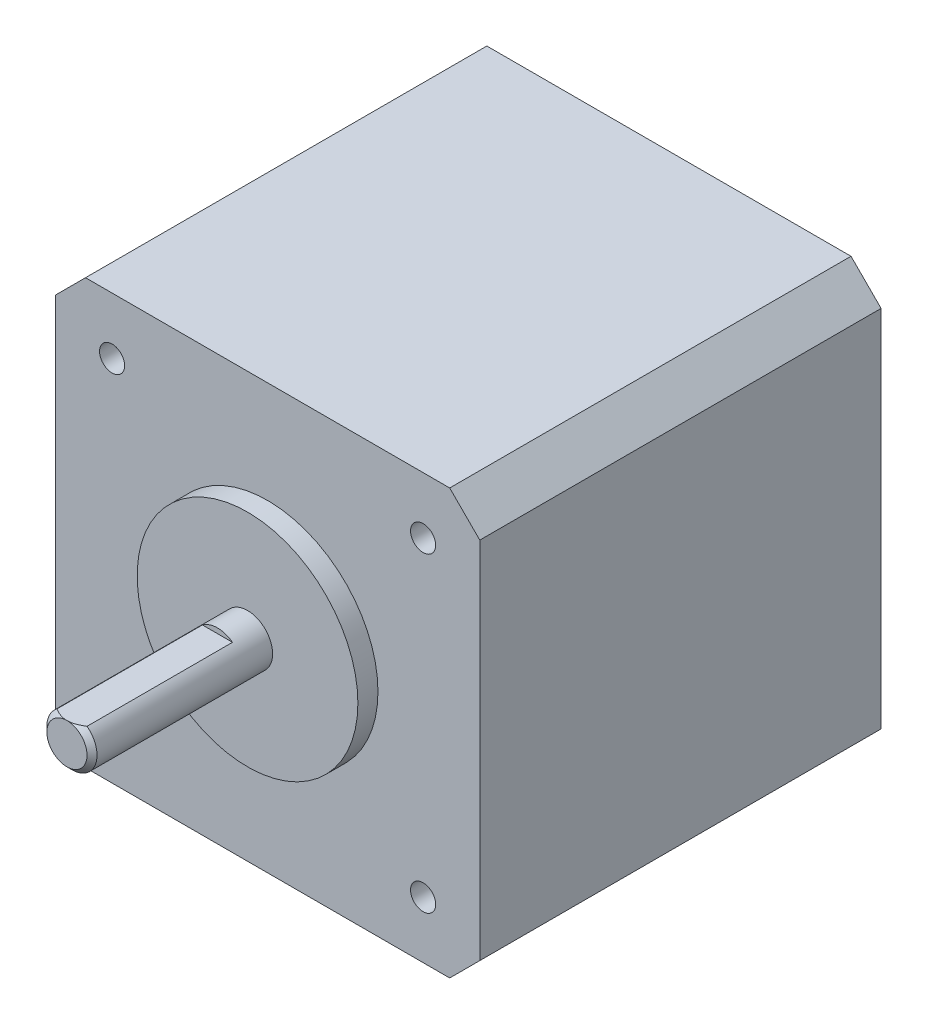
ISO-10303-21;
HEADER;
FILE_DESCRIPTION(('STEP AP214'),'2;1');
FILE_NAME('part.step','',(''),(''),'','','');
FILE_SCHEMA(('AUTOMOTIVE_DESIGN { 1 0 10303 214 1 1 1 1 }'));
ENDSEC;
DATA;
#1=APPLICATION_CONTEXT('core data for automotive mechanical design processes');
#2=APPLICATION_PROTOCOL_DEFINITION('international standard','automotive_design',2000,#1);
#3=PRODUCT_CONTEXT('',#1,'mechanical');
#4=PRODUCT('Part','Part','',(#3));
#5=PRODUCT_RELATED_PRODUCT_CATEGORY('part','',(#4));
#6=PRODUCT_DEFINITION_FORMATION('','',#4);
#7=PRODUCT_DEFINITION_CONTEXT('part definition',#1,'design');
#8=PRODUCT_DEFINITION('design','',#6,#7);
#9=PRODUCT_DEFINITION_SHAPE('','',#8);
#10=(LENGTH_UNIT() NAMED_UNIT(*) SI_UNIT(.MILLI.,.METRE.));
#11=(NAMED_UNIT(*) PLANE_ANGLE_UNIT() SI_UNIT($,.RADIAN.));
#12=(NAMED_UNIT(*) SI_UNIT($,.STERADIAN.) SOLID_ANGLE_UNIT());
#13=UNCERTAINTY_MEASURE_WITH_UNIT(LENGTH_MEASURE(1.E-05),#10,'distance_accuracy_value','');
#14=(GEOMETRIC_REPRESENTATION_CONTEXT(3) GLOBAL_UNCERTAINTY_ASSIGNED_CONTEXT((#13)) GLOBAL_UNIT_ASSIGNED_CONTEXT((#10,
#11,#12)) REPRESENTATION_CONTEXT('',''));
#15=CARTESIAN_POINT('',(0.,0.,0.));
#16=DIRECTION('',(0.,0.,1.));
#17=DIRECTION('',(1.,0.,0.));
#18=AXIS2_PLACEMENT_3D('',#15,#16,#17);
#19=CARTESIAN_POINT('',(0.,0.,0.));
#20=DIRECTION('',(0.,0.,1.));
#21=DIRECTION('',(1.,0.,0.));
#22=AXIS2_PLACEMENT_3D('',#19,#20,#21);
#23=PLANE('',#22);
#24=CARTESIAN_POINT('',(0.,0.,0.));
#25=DIRECTION('',(0.,0.,1.));
#26=DIRECTION('',(1.,0.,0.));
#27=AXIS2_PLACEMENT_3D('',#24,#25,#26);
#28=CIRCLE('',#27,11.);
#29=CARTESIAN_POINT('',(11.,0.,0.));
#30=VERTEX_POINT('',#29);
#31=EDGE_CURVE('E230',#30,#30,#28,.T.);
#32=ORIENTED_EDGE('',*,*,#31,.T.);
#33=EDGE_LOOP('',(#32));
#34=FACE_BOUND('',#33,.T.);
#35=CARTESIAN_POINT('',(0.,0.,0.));
#36=DIRECTION('',(0.,0.,1.));
#37=DIRECTION('',(1.,0.,0.));
#38=AXIS2_PLACEMENT_3D('',#35,#36,#37);
#39=CIRCLE('',#38,2.5);
#40=CARTESIAN_POINT('',(2.5,0.,0.));
#41=VERTEX_POINT('',#40);
#42=EDGE_CURVE('E227',#41,#41,#39,.T.);
#43=ORIENTED_EDGE('',*,*,#42,.F.);
#44=EDGE_LOOP('',(#43));
#45=FACE_BOUND('',#44,.T.);
#46=ADVANCED_FACE('F37',(#34,#45),#23,.T.);
#47=CARTESIAN_POINT('',(0.,0.,-2.));
#48=DIRECTION('',(0.,0.,1.));
#49=DIRECTION('',(1.,0.,0.));
#50=AXIS2_PLACEMENT_3D('',#47,#48,#49);
#51=CYLINDRICAL_SURFACE('',#50,11.);
#52=CARTESIAN_POINT('',(0.,0.,-2.));
#53=DIRECTION('',(0.,0.,1.));
#54=DIRECTION('',(1.,0.,0.));
#55=AXIS2_PLACEMENT_3D('',#52,#53,#54);
#56=CIRCLE('',#55,11.);
#57=CARTESIAN_POINT('',(11.,0.,-2.));
#58=VERTEX_POINT('',#57);
#59=EDGE_CURVE('E217',#58,#58,#56,.F.);
#60=ORIENTED_EDGE('',*,*,#59,.F.);
#61=EDGE_LOOP('',(#60));
#62=FACE_BOUND('',#61,.T.);
#63=ORIENTED_EDGE('',*,*,#31,.F.);
#64=EDGE_LOOP('',(#63));
#65=FACE_BOUND('',#64,.T.);
#66=ADVANCED_FACE('F262',(#62,#65),#51,.T.);
#67=CARTESIAN_POINT('',(0.,0.,18.));
#68=DIRECTION('',(0.,0.,-1.));
#69=DIRECTION('',(-1.,0.,0.));
#70=AXIS2_PLACEMENT_3D('',#67,#68,#69);
#71=CYLINDRICAL_SURFACE('',#70,2.5);
#72=DIRECTION('',(0.,0.,-1.));
#73=VECTOR('',#72,1.);
#74=CARTESIAN_POINT('',(1.5,2.,18.));
#75=LINE('',#74,#73);
#76=CARTESIAN_POINT('',(1.5,2.,3.));
#77=VERTEX_POINT('',#76);
#78=CARTESIAN_POINT('',(1.5,2.,17.5));
#79=VERTEX_POINT('',#78);
#80=EDGE_CURVE('E223',#77,#79,#75,.F.);
#81=ORIENTED_EDGE('',*,*,#80,.T.);
#82=CARTESIAN_POINT('',(0.,0.,17.5));
#83=DIRECTION('',(0.,0.,1.));
#84=DIRECTION('',(1.,0.,0.));
#85=AXIS2_PLACEMENT_3D('',#82,#83,#84);
#86=CIRCLE('',#85,2.5);
#87=CARTESIAN_POINT('',(-1.5,2.,17.5));
#88=VERTEX_POINT('',#87);
#89=EDGE_CURVE('E11',#79,#88,#86,.F.);
#90=ORIENTED_EDGE('',*,*,#89,.T.);
#91=DIRECTION('',(0.,0.,-1.));
#92=VECTOR('',#91,1.);
#93=CARTESIAN_POINT('',(-1.5,2.,18.));
#94=LINE('',#93,#92);
#95=CARTESIAN_POINT('',(-1.5,2.,3.));
#96=VERTEX_POINT('',#95);
#97=EDGE_CURVE('E225',#88,#96,#94,.T.);
#98=ORIENTED_EDGE('',*,*,#97,.T.);
#99=CARTESIAN_POINT('',(0.,0.,3.));
#100=DIRECTION('',(0.,0.,1.));
#101=DIRECTION('',(1.,0.,0.));
#102=AXIS2_PLACEMENT_3D('',#99,#100,#101);
#103=CIRCLE('',#102,2.5);
#104=EDGE_CURVE('E233',#77,#96,#103,.T.);
#105=ORIENTED_EDGE('',*,*,#104,.F.);
#106=EDGE_LOOP('',(#81,#90,#98,#105));
#107=FACE_BOUND('',#106,.T.);
#108=ORIENTED_EDGE('',*,*,#42,.T.);
#109=EDGE_LOOP('',(#108));
#110=FACE_BOUND('',#109,.T.);
#111=ADVANCED_FACE('F258',(#107,#110),#71,.T.);
#112=CARTESIAN_POINT('',(0.,0.,18.));
#113=DIRECTION('',(0.,0.,1.));
#114=DIRECTION('',(1.,0.,0.));
#115=AXIS2_PLACEMENT_3D('',#112,#113,#114);
#116=PLANE('',#115);
#117=CARTESIAN_POINT('',(0.,0.,18.));
#118=DIRECTION('',(0.,0.,1.));
#119=DIRECTION('',(1.,0.,0.));
#120=AXIS2_PLACEMENT_3D('',#117,#118,#119);
#121=CIRCLE('',#120,2.00000000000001);
#122=CARTESIAN_POINT('',(0.,2.,18.));
#123=VERTEX_POINT('',#122);
#124=EDGE_CURVE('E236',#123,#123,#121,.T.);
#125=ORIENTED_EDGE('',*,*,#124,.T.);
#126=EDGE_LOOP('',(#125));
#127=FACE_BOUND('',#126,.T.);
#128=ADVANCED_FACE('F254',(#127),#116,.T.);
#129=CARTESIAN_POINT('',(0.,0.,3.));
#130=DIRECTION('',(0.,0.,1.));
#131=DIRECTION('',(1.,0.,0.));
#132=AXIS2_PLACEMENT_3D('',#129,#130,#131);
#133=PLANE('',#132);
#134=ORIENTED_EDGE('',*,*,#104,.T.);
#135=DIRECTION('',(1.,0.,0.));
#136=VECTOR('',#135,1.);
#137=CARTESIAN_POINT('',(-2.5,2.,3.));
#138=LINE('',#137,#136);
#139=EDGE_CURVE('E220',#96,#77,#138,.T.);
#140=ORIENTED_EDGE('',*,*,#139,.T.);
#141=EDGE_LOOP('',(#134,#140));
#142=FACE_BOUND('',#141,.T.);
#143=ADVANCED_FACE('F252',(#142),#133,.T.);
#144=CARTESIAN_POINT('',(0.,2.,3.));
#145=DIRECTION('',(0.,-1.,0.));
#146=DIRECTION('',(0.,0.,-1.));
#147=AXIS2_PLACEMENT_3D('',#144,#145,#146);
#148=PLANE('',#147);
#149=CARTESIAN_POINT('',(-1.5,2.,17.5));
#150=CARTESIAN_POINT('',(-1.42763018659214,2.,17.5433736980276));
#151=CARTESIAN_POINT('',(-1.35436226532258,2.,17.5853687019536));
#152=CARTESIAN_POINT('',(-1.20549660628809,2.,17.6656443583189));
#153=CARTESIAN_POINT('',(-1.12989157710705,2.,17.7039114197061));
#154=CARTESIAN_POINT('',(-0.978296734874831,2.,17.774534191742));
#155=CARTESIAN_POINT('',(-0.902366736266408,2.,17.8070165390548));
#156=CARTESIAN_POINT('',(-0.748220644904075,2.,17.8658090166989));
#157=CARTESIAN_POINT('',(-0.670007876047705,2.,17.8921276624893));
#158=CARTESIAN_POINT('',(-0.543060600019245,2.,17.9280861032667));
#159=CARTESIAN_POINT('',(-0.495021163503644,2.,17.9401901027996));
#160=CARTESIAN_POINT('',(-0.398260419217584,2.,17.9612794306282));
#161=CARTESIAN_POINT('',(-0.349539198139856,2.,17.9702651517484));
#162=CARTESIAN_POINT('',(-0.250852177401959,2.,17.984927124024));
#163=CARTESIAN_POINT('',(-0.20087865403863,2.,17.9905520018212));
#164=CARTESIAN_POINT('',(-0.100607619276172,2.,17.9981023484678));
#165=CARTESIAN_POINT('',(-0.0503098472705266,2.,18.0000243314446));
#166=CARTESIAN_POINT('',(0.,2.,18.));
#167=B_SPLINE_CURVE_WITH_KNOTS('',3,(#149,#150,#151,#152,#153,#154,#155,#156,#157,#158,#159,
#160,#161,#162,#163,#164,#165,#166),.UNSPECIFIED.,.F.,.F.,(4,2,2,2,2,2,2,2,4),(0.,
0.253195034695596,0.507281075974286,0.754837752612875,1.00205037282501,1.15058504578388,
1.29910100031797,1.44983263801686,1.600706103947),.UNSPECIFIED.);
#168=EDGE_CURVE('E239',#88,#123,#167,.T.);
#169=ORIENTED_EDGE('',*,*,#168,.T.);
#170=CARTESIAN_POINT('',(0.,2.00000000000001,18.));
#171=CARTESIAN_POINT('',(0.0614966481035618,2.,18.0000514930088));
#172=CARTESIAN_POINT('',(0.122961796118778,2.,17.997164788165));
#173=CARTESIAN_POINT('',(0.245274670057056,2.,17.9859212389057));
#174=CARTESIAN_POINT('',(0.306123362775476,2.,17.9775750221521));
#175=CARTESIAN_POINT('',(0.425885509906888,2.,17.9559969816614));
#176=CARTESIAN_POINT('',(0.484814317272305,2.,17.9428488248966));
#177=CARTESIAN_POINT('',(0.601555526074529,2.,17.9122507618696));
#178=CARTESIAN_POINT('',(0.659367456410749,2.,17.8947990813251));
#179=CARTESIAN_POINT('',(0.784576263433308,2.,17.8525702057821));
#180=CARTESIAN_POINT('',(0.851714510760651,2.,17.8270315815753));
#181=CARTESIAN_POINT('',(0.984250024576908,2.,17.7717452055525));
#182=CARTESIAN_POINT('',(1.04964642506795,2.,17.7419954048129));
#183=CARTESIAN_POINT('',(1.18016546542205,2.,17.6784785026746));
#184=CARTESIAN_POINT('',(1.24525271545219,2.,17.6446394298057));
#185=CARTESIAN_POINT('',(1.37378197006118,2.,17.5742160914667));
#186=CARTESIAN_POINT('',(1.43722666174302,2.,17.5376367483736));
#187=CARTESIAN_POINT('',(1.5,2.,17.5));
#188=B_SPLINE_CURVE_WITH_KNOTS('',3,(#170,#171,#172,#173,#174,#175,#176,#177,#178,#179,#180,
#181,#182,#183,#184,#185,#186,#187),.UNSPECIFIED.,.F.,.F.,(4,2,2,2,2,2,2,2,4),(0.,
0.184371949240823,0.368386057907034,0.549336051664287,0.730360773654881,0.945674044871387,
1.16109243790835,1.38109142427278,1.60070428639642),.UNSPECIFIED.);
#189=EDGE_CURVE('E46',#123,#79,#188,.T.);
#190=ORIENTED_EDGE('',*,*,#189,.T.);
#191=ORIENTED_EDGE('',*,*,#80,.F.);
#192=ORIENTED_EDGE('',*,*,#139,.F.);
#193=ORIENTED_EDGE('',*,*,#97,.F.);
#194=EDGE_LOOP('',(#169,#190,#191,#192,#193));
#195=FACE_BOUND('',#194,.T.);
#196=ADVANCED_FACE('F247',(#195),#148,.F.);
#197=CARTESIAN_POINT('',(0.,0.,18.));
#198=DIRECTION('',(0.,0.,-1.));
#199=DIRECTION('',(-1.,0.,0.));
#200=AXIS2_PLACEMENT_3D('',#197,#198,#199);
#201=CONICAL_SURFACE('',#200,2.00000000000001,0.785398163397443);
#202=ORIENTED_EDGE('',*,*,#168,.F.);
#203=ORIENTED_EDGE('',*,*,#89,.F.);
#204=ORIENTED_EDGE('',*,*,#189,.F.);
#205=ORIENTED_EDGE('',*,*,#124,.F.);
#206=EDGE_LOOP('',(#202,#203,#204,#205));
#207=FACE_BOUND('',#206,.T.);
#208=ADVANCED_FACE('F39',(#207),#201,.T.);
#209=CARTESIAN_POINT('',(21.15,-18.15,-42.));
#210=DIRECTION('',(-1.,0.,0.));
#211=DIRECTION('',(0.,0.,1.));
#212=AXIS2_PLACEMENT_3D('',#209,#210,#211);
#213=PLANE('',#212);
#214=DIRECTION('',(0.,-1.,0.));
#215=VECTOR('',#214,1.);
#216=CARTESIAN_POINT('',(21.15,-18.15,-2.));
#217=LINE('',#216,#215);
#218=CARTESIAN_POINT('',(21.15,18.15,-2.));
#219=VERTEX_POINT('',#218);
#220=CARTESIAN_POINT('',(21.15,-18.15,-2.));
#221=VERTEX_POINT('',#220);
#222=EDGE_CURVE('E158',#219,#221,#217,.T.);
#223=ORIENTED_EDGE('',*,*,#222,.T.);
#224=DIRECTION('',(0.,0.,1.));
#225=VECTOR('',#224,1.);
#226=CARTESIAN_POINT('',(21.15,-18.15,-42.));
#227=LINE('',#226,#225);
#228=CARTESIAN_POINT('',(21.15,-18.15,-42.));
#229=VERTEX_POINT('',#228);
#230=EDGE_CURVE('E214',#229,#221,#227,.T.);
#231=ORIENTED_EDGE('',*,*,#230,.F.);
#232=DIRECTION('',(0.,-1.,0.));
#233=VECTOR('',#232,1.);
#234=CARTESIAN_POINT('',(21.15,-18.15,-42.));
#235=LINE('',#234,#233);
#236=CARTESIAN_POINT('',(21.15,18.15,-42.));
#237=VERTEX_POINT('',#236);
#238=EDGE_CURVE('E159',#237,#229,#235,.T.);
#239=ORIENTED_EDGE('',*,*,#238,.F.);
#240=DIRECTION('',(0.,0.,1.));
#241=VECTOR('',#240,1.);
#242=CARTESIAN_POINT('',(21.15,18.15,-42.));
#243=LINE('',#242,#241);
#244=EDGE_CURVE('E177',#237,#219,#243,.T.);
#245=ORIENTED_EDGE('',*,*,#244,.T.);
#246=EDGE_LOOP('',(#223,#231,#239,#245));
#247=FACE_BOUND('',#246,.T.);
#248=ADVANCED_FACE('F288',(#247),#213,.F.);
#249=CARTESIAN_POINT('',(18.15,-21.15,-42.));
#250=DIRECTION('',(-0.707106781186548,0.707106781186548,0.));
#251=DIRECTION('',(-0.707106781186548,-0.707106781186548,0.));
#252=AXIS2_PLACEMENT_3D('',#249,#250,#251);
#253=PLANE('',#252);
#254=DIRECTION('',(-0.707106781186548,-0.707106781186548,0.));
#255=VECTOR('',#254,1.);
#256=CARTESIAN_POINT('',(18.15,-21.15,-2.));
#257=LINE('',#256,#255);
#258=CARTESIAN_POINT('',(18.15,-21.15,-2.));
#259=VERTEX_POINT('',#258);
#260=EDGE_CURVE('E180',#221,#259,#257,.T.);
#261=ORIENTED_EDGE('',*,*,#260,.T.);
#262=DIRECTION('',(0.,0.,1.));
#263=VECTOR('',#262,1.);
#264=CARTESIAN_POINT('',(18.15,-21.15,-42.));
#265=LINE('',#264,#263);
#266=CARTESIAN_POINT('',(18.15,-21.15,-42.));
#267=VERTEX_POINT('',#266);
#268=EDGE_CURVE('E211',#267,#259,#265,.T.);
#269=ORIENTED_EDGE('',*,*,#268,.F.);
#270=DIRECTION('',(-0.707106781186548,-0.707106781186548,0.));
#271=VECTOR('',#270,1.);
#272=CARTESIAN_POINT('',(18.15,-21.15,-42.));
#273=LINE('',#272,#271);
#274=EDGE_CURVE('E162',#229,#267,#273,.T.);
#275=ORIENTED_EDGE('',*,*,#274,.F.);
#276=ORIENTED_EDGE('',*,*,#230,.T.);
#277=EDGE_LOOP('',(#261,#269,#275,#276));
#278=FACE_BOUND('',#277,.T.);
#279=ADVANCED_FACE('F319',(#278),#253,.F.);
#280=CARTESIAN_POINT('',(-18.15,-21.15,-42.));
#281=DIRECTION('',(0.,1.,0.));
#282=DIRECTION('',(-1.,0.,0.));
#283=AXIS2_PLACEMENT_3D('',#280,#281,#282);
#284=PLANE('',#283);
#285=DIRECTION('',(-1.,0.,0.));
#286=VECTOR('',#285,1.);
#287=CARTESIAN_POINT('',(-18.15,-21.15,-2.));
#288=LINE('',#287,#286);
#289=CARTESIAN_POINT('',(-18.15,-21.15,-2.));
#290=VERTEX_POINT('',#289);
#291=EDGE_CURVE('E182',#259,#290,#288,.T.);
#292=ORIENTED_EDGE('',*,*,#291,.T.);
#293=DIRECTION('',(0.,0.,1.));
#294=VECTOR('',#293,1.);
#295=CARTESIAN_POINT('',(-18.15,-21.15,-42.));
#296=LINE('',#295,#294);
#297=CARTESIAN_POINT('',(-18.15,-21.15,-42.));
#298=VERTEX_POINT('',#297);
#299=EDGE_CURVE('E208',#298,#290,#296,.T.);
#300=ORIENTED_EDGE('',*,*,#299,.F.);
#301=DIRECTION('',(-1.,0.,0.));
#302=VECTOR('',#301,1.);
#303=CARTESIAN_POINT('',(-18.15,-21.15,-42.));
#304=LINE('',#303,#302);
#305=EDGE_CURVE('E165',#267,#298,#304,.T.);
#306=ORIENTED_EDGE('',*,*,#305,.F.);
#307=ORIENTED_EDGE('',*,*,#268,.T.);
#308=EDGE_LOOP('',(#292,#300,#306,#307));
#309=FACE_BOUND('',#308,.T.);
#310=ADVANCED_FACE('F316',(#309),#284,.F.);
#311=CARTESIAN_POINT('',(-21.15,-18.15,-42.));
#312=DIRECTION('',(0.707106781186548,0.707106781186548,0.));
#313=DIRECTION('',(-0.707106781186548,0.707106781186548,0.));
#314=AXIS2_PLACEMENT_3D('',#311,#312,#313);
#315=PLANE('',#314);
#316=DIRECTION('',(-0.707106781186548,0.707106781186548,0.));
#317=VECTOR('',#316,1.);
#318=CARTESIAN_POINT('',(-21.15,-18.15,-2.));
#319=LINE('',#318,#317);
#320=CARTESIAN_POINT('',(-21.15,-18.15,-2.));
#321=VERTEX_POINT('',#320);
#322=EDGE_CURVE('E184',#290,#321,#319,.T.);
#323=ORIENTED_EDGE('',*,*,#322,.T.);
#324=DIRECTION('',(0.,0.,1.));
#325=VECTOR('',#324,1.);
#326=CARTESIAN_POINT('',(-21.15,-18.15,-42.));
#327=LINE('',#326,#325);
#328=CARTESIAN_POINT('',(-21.15,-18.15,-42.));
#329=VERTEX_POINT('',#328);
#330=EDGE_CURVE('E205',#329,#321,#327,.T.);
#331=ORIENTED_EDGE('',*,*,#330,.F.);
#332=DIRECTION('',(-0.707106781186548,0.707106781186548,0.));
#333=VECTOR('',#332,1.);
#334=CARTESIAN_POINT('',(-21.15,-18.15,-42.));
#335=LINE('',#334,#333);
#336=EDGE_CURVE('E167',#298,#329,#335,.T.);
#337=ORIENTED_EDGE('',*,*,#336,.F.);
#338=ORIENTED_EDGE('',*,*,#299,.T.);
#339=EDGE_LOOP('',(#323,#331,#337,#338));
#340=FACE_BOUND('',#339,.T.);
#341=ADVANCED_FACE('F311',(#340),#315,.F.);
#342=CARTESIAN_POINT('',(-21.15,18.15,-42.));
#343=DIRECTION('',(1.,0.,0.));
#344=DIRECTION('',(0.,1.,0.));
#345=AXIS2_PLACEMENT_3D('',#342,#343,#344);
#346=PLANE('',#345);
#347=DIRECTION('',(0.,1.,0.));
#348=VECTOR('',#347,1.);
#349=CARTESIAN_POINT('',(-21.15,18.15,-2.));
#350=LINE('',#349,#348);
#351=CARTESIAN_POINT('',(-21.15,18.15,-2.));
#352=VERTEX_POINT('',#351);
#353=EDGE_CURVE('E186',#321,#352,#350,.T.);
#354=ORIENTED_EDGE('',*,*,#353,.T.);
#355=DIRECTION('',(0.,0.,1.));
#356=VECTOR('',#355,1.);
#357=CARTESIAN_POINT('',(-21.15,18.15,-42.));
#358=LINE('',#357,#356);
#359=CARTESIAN_POINT('',(-21.15,18.15,-42.));
#360=VERTEX_POINT('',#359);
#361=EDGE_CURVE('E202',#360,#352,#358,.T.);
#362=ORIENTED_EDGE('',*,*,#361,.F.);
#363=DIRECTION('',(0.,1.,0.));
#364=VECTOR('',#363,1.);
#365=CARTESIAN_POINT('',(-21.15,18.15,-42.));
#366=LINE('',#365,#364);
#367=EDGE_CURVE('E169',#329,#360,#366,.T.);
#368=ORIENTED_EDGE('',*,*,#367,.F.);
#369=ORIENTED_EDGE('',*,*,#330,.T.);
#370=EDGE_LOOP('',(#354,#362,#368,#369));
#371=FACE_BOUND('',#370,.T.);
#372=ADVANCED_FACE('F307',(#371),#346,.F.);
#373=CARTESIAN_POINT('',(-18.15,21.15,-42.));
#374=DIRECTION('',(0.707106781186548,-0.707106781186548,0.));
#375=DIRECTION('',(0.707106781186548,0.707106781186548,0.));
#376=AXIS2_PLACEMENT_3D('',#373,#374,#375);
#377=PLANE('',#376);
#378=DIRECTION('',(0.707106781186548,0.707106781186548,0.));
#379=VECTOR('',#378,1.);
#380=CARTESIAN_POINT('',(-18.15,21.15,-2.));
#381=LINE('',#380,#379);
#382=CARTESIAN_POINT('',(-18.15,21.15,-2.));
#383=VERTEX_POINT('',#382);
#384=EDGE_CURVE('E188',#352,#383,#381,.T.);
#385=ORIENTED_EDGE('',*,*,#384,.T.);
#386=DIRECTION('',(0.,0.,1.));
#387=VECTOR('',#386,1.);
#388=CARTESIAN_POINT('',(-18.15,21.15,-42.));
#389=LINE('',#388,#387);
#390=CARTESIAN_POINT('',(-18.15,21.15,-42.));
#391=VERTEX_POINT('',#390);
#392=EDGE_CURVE('E199',#391,#383,#389,.T.);
#393=ORIENTED_EDGE('',*,*,#392,.F.);
#394=DIRECTION('',(0.707106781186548,0.707106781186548,0.));
#395=VECTOR('',#394,1.);
#396=CARTESIAN_POINT('',(-18.15,21.15,-42.));
#397=LINE('',#396,#395);
#398=EDGE_CURVE('E171',#360,#391,#397,.T.);
#399=ORIENTED_EDGE('',*,*,#398,.F.);
#400=ORIENTED_EDGE('',*,*,#361,.T.);
#401=EDGE_LOOP('',(#385,#393,#399,#400));
#402=FACE_BOUND('',#401,.T.);
#403=ADVANCED_FACE('F302',(#402),#377,.F.);
#404=CARTESIAN_POINT('',(18.15,21.15,-42.));
#405=DIRECTION('',(0.,-1.,0.));
#406=DIRECTION('',(0.,0.,-1.));
#407=AXIS2_PLACEMENT_3D('',#404,#405,#406);
#408=PLANE('',#407);
#409=DIRECTION('',(1.,0.,0.));
#410=VECTOR('',#409,1.);
#411=CARTESIAN_POINT('',(18.15,21.15,-2.));
#412=LINE('',#411,#410);
#413=CARTESIAN_POINT('',(18.15,21.15,-2.));
#414=VERTEX_POINT('',#413);
#415=EDGE_CURVE('E191',#383,#414,#412,.T.);
#416=ORIENTED_EDGE('',*,*,#415,.T.);
#417=DIRECTION('',(0.,0.,1.));
#418=VECTOR('',#417,1.);
#419=CARTESIAN_POINT('',(18.15,21.15,-42.));
#420=LINE('',#419,#418);
#421=CARTESIAN_POINT('',(18.15,21.15,-42.));
#422=VERTEX_POINT('',#421);
#423=EDGE_CURVE('E196',#422,#414,#420,.T.);
#424=ORIENTED_EDGE('',*,*,#423,.F.);
#425=DIRECTION('',(1.,0.,0.));
#426=VECTOR('',#425,1.);
#427=CARTESIAN_POINT('',(0.,21.15,-42.));
#428=LINE('',#427,#426);
#429=EDGE_CURVE('E173',#391,#422,#428,.T.);
#430=ORIENTED_EDGE('',*,*,#429,.F.);
#431=ORIENTED_EDGE('',*,*,#392,.T.);
#432=EDGE_LOOP('',(#416,#424,#430,#431));
#433=FACE_BOUND('',#432,.T.);
#434=ADVANCED_FACE('F297',(#433),#408,.F.);
#435=CARTESIAN_POINT('',(21.15,18.15,-42.));
#436=DIRECTION('',(-0.707106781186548,-0.707106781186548,0.));
#437=DIRECTION('',(0.707106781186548,-0.707106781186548,0.));
#438=AXIS2_PLACEMENT_3D('',#435,#436,#437);
#439=PLANE('',#438);
#440=DIRECTION('',(0.707106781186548,-0.707106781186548,0.));
#441=VECTOR('',#440,1.);
#442=CARTESIAN_POINT('',(21.15,18.15,-2.));
#443=LINE('',#442,#441);
#444=EDGE_CURVE('E163',#414,#219,#443,.T.);
#445=ORIENTED_EDGE('',*,*,#444,.T.);
#446=ORIENTED_EDGE('',*,*,#244,.F.);
#447=DIRECTION('',(0.707106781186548,-0.707106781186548,0.));
#448=VECTOR('',#447,1.);
#449=CARTESIAN_POINT('',(21.15,18.15,-42.));
#450=LINE('',#449,#448);
#451=EDGE_CURVE('E175',#422,#237,#450,.T.);
#452=ORIENTED_EDGE('',*,*,#451,.F.);
#453=ORIENTED_EDGE('',*,*,#423,.T.);
#454=EDGE_LOOP('',(#445,#446,#452,#453));
#455=FACE_BOUND('',#454,.T.);
#456=ADVANCED_FACE('F293',(#455),#439,.F.);
#457=CARTESIAN_POINT('',(0.,0.,-42.));
#458=DIRECTION('',(0.,0.,1.));
#459=DIRECTION('',(1.,0.,0.));
#460=AXIS2_PLACEMENT_3D('',#457,#458,#459);
#461=PLANE('',#460);
#462=ORIENTED_EDGE('',*,*,#238,.T.);
#463=ORIENTED_EDGE('',*,*,#274,.T.);
#464=ORIENTED_EDGE('',*,*,#305,.T.);
#465=ORIENTED_EDGE('',*,*,#336,.T.);
#466=ORIENTED_EDGE('',*,*,#367,.T.);
#467=ORIENTED_EDGE('',*,*,#398,.T.);
#468=ORIENTED_EDGE('',*,*,#429,.T.);
#469=ORIENTED_EDGE('',*,*,#451,.T.);
#470=EDGE_LOOP('',(#462,#463,#464,#465,#466,#467,#468,#469));
#471=FACE_BOUND('',#470,.T.);
#472=ADVANCED_FACE('F280',(#471),#461,.F.);
#473=CARTESIAN_POINT('',(0.,0.,-2.));
#474=DIRECTION('',(0.,0.,1.));
#475=DIRECTION('',(1.,0.,0.));
#476=AXIS2_PLACEMENT_3D('',#473,#474,#475);
#477=PLANE('',#476);
#478=CARTESIAN_POINT('',(-15.5,15.5,-2.));
#479=DIRECTION('',(0.,0.,1.));
#480=DIRECTION('',(1.,0.,0.));
#481=AXIS2_PLACEMENT_3D('',#478,#479,#480);
#482=CIRCLE('',#481,1.24999999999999);
#483=CARTESIAN_POINT('',(-14.25,15.5,-2.));
#484=VERTEX_POINT('',#483);
#485=EDGE_CURVE('E136',#484,#484,#482,.T.);
#486=ORIENTED_EDGE('',*,*,#485,.F.);
#487=EDGE_LOOP('',(#486));
#488=FACE_BOUND('',#487,.T.);
#489=CARTESIAN_POINT('',(15.5,15.5,-2.));
#490=DIRECTION('',(0.,0.,1.));
#491=DIRECTION('',(1.,0.,0.));
#492=AXIS2_PLACEMENT_3D('',#489,#490,#491);
#493=CIRCLE('',#492,1.24999999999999);
#494=CARTESIAN_POINT('',(16.75,15.5,-2.));
#495=VERTEX_POINT('',#494);
#496=EDGE_CURVE('E135',#495,#495,#493,.T.);
#497=ORIENTED_EDGE('',*,*,#496,.F.);
#498=EDGE_LOOP('',(#497));
#499=FACE_BOUND('',#498,.T.);
#500=CARTESIAN_POINT('',(15.5,-15.5,-2.));
#501=DIRECTION('',(0.,0.,1.));
#502=DIRECTION('',(1.,0.,0.));
#503=AXIS2_PLACEMENT_3D('',#500,#501,#502);
#504=CIRCLE('',#503,1.24999999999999);
#505=CARTESIAN_POINT('',(16.75,-15.5,-2.));
#506=VERTEX_POINT('',#505);
#507=EDGE_CURVE('E146',#506,#506,#504,.T.);
#508=ORIENTED_EDGE('',*,*,#507,.F.);
#509=EDGE_LOOP('',(#508));
#510=FACE_BOUND('',#509,.T.);
#511=CARTESIAN_POINT('',(-15.5,-15.5,-2.));
#512=DIRECTION('',(0.,0.,1.));
#513=DIRECTION('',(1.,0.,0.));
#514=AXIS2_PLACEMENT_3D('',#511,#512,#513);
#515=CIRCLE('',#514,1.24999999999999);
#516=CARTESIAN_POINT('',(-14.25,-15.5,-2.));
#517=VERTEX_POINT('',#516);
#518=EDGE_CURVE('E152',#517,#517,#515,.T.);
#519=ORIENTED_EDGE('',*,*,#518,.F.);
#520=EDGE_LOOP('',(#519));
#521=FACE_BOUND('',#520,.T.);
#522=ORIENTED_EDGE('',*,*,#59,.T.);
#523=EDGE_LOOP('',(#522));
#524=FACE_BOUND('',#523,.T.);
#525=ORIENTED_EDGE('',*,*,#222,.F.);
#526=ORIENTED_EDGE('',*,*,#444,.F.);
#527=ORIENTED_EDGE('',*,*,#415,.F.);
#528=ORIENTED_EDGE('',*,*,#384,.F.);
#529=ORIENTED_EDGE('',*,*,#353,.F.);
#530=ORIENTED_EDGE('',*,*,#322,.F.);
#531=ORIENTED_EDGE('',*,*,#291,.F.);
#532=ORIENTED_EDGE('',*,*,#260,.F.);
#533=EDGE_LOOP('',(#525,#526,#527,#528,#529,#530,#531,#532));
#534=FACE_BOUND('',#533,.T.);
#535=ADVANCED_FACE('F276',(#488,#499,#510,#521,#524,#534),#477,.T.);
#536=CARTESIAN_POINT('',(-15.5,-15.5,-9.));
#537=DIRECTION('',(0.,0.,1.));
#538=DIRECTION('',(1.,0.,0.));
#539=AXIS2_PLACEMENT_3D('',#536,#537,#538);
#540=CONICAL_SURFACE('',#539,1.25,1.02974425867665);
#541=CARTESIAN_POINT('',(-15.5,-15.5,-9.75107577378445));
#542=VERTEX_POINT('',#541);
#543=VERTEX_LOOP('',#542);
#544=FACE_BOUND('',#543,.T.);
#545=CARTESIAN_POINT('',(-15.5,-15.5,-9.));
#546=DIRECTION('',(0.,0.,1.));
#547=DIRECTION('',(1.,0.,0.));
#548=AXIS2_PLACEMENT_3D('',#545,#546,#547);
#549=CIRCLE('',#548,1.25);
#550=CARTESIAN_POINT('',(-14.25,-15.5,-9.));
#551=VERTEX_POINT('',#550);
#552=EDGE_CURVE('E155',#551,#551,#549,.T.);
#553=ORIENTED_EDGE('',*,*,#552,.T.);
#554=EDGE_LOOP('',(#553));
#555=FACE_BOUND('',#554,.T.);
#556=ADVANCED_FACE('F279',(#544,#555),#540,.F.);
#557=CARTESIAN_POINT('',(-15.5,-15.5,-2.));
#558=DIRECTION('',(0.,0.,1.));
#559=DIRECTION('',(1.,0.,0.));
#560=AXIS2_PLACEMENT_3D('',#557,#558,#559);
#561=CYLINDRICAL_SURFACE('',#560,1.24999999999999);
#562=ORIENTED_EDGE('',*,*,#552,.F.);
#563=EDGE_LOOP('',(#562));
#564=FACE_BOUND('',#563,.T.);
#565=ORIENTED_EDGE('',*,*,#518,.T.);
#566=EDGE_LOOP('',(#565));
#567=FACE_BOUND('',#566,.T.);
#568=ADVANCED_FACE('F437',(#564,#567),#561,.F.);
#569=CARTESIAN_POINT('',(15.5,-15.5,-9.));
#570=DIRECTION('',(0.,0.,1.));
#571=DIRECTION('',(1.,0.,0.));
#572=AXIS2_PLACEMENT_3D('',#569,#570,#571);
#573=CONICAL_SURFACE('',#572,1.25,1.02974425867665);
#574=CARTESIAN_POINT('',(15.5,-15.5,-9.75107577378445));
#575=VERTEX_POINT('',#574);
#576=VERTEX_LOOP('',#575);
#577=FACE_BOUND('',#576,.T.);
#578=CARTESIAN_POINT('',(15.5,-15.5,-9.));
#579=DIRECTION('',(0.,0.,1.));
#580=DIRECTION('',(1.,0.,0.));
#581=AXIS2_PLACEMENT_3D('',#578,#579,#580);
#582=CIRCLE('',#581,1.25);
#583=CARTESIAN_POINT('',(16.75,-15.5,-9.));
#584=VERTEX_POINT('',#583);
#585=EDGE_CURVE('E149',#584,#584,#582,.T.);
#586=ORIENTED_EDGE('',*,*,#585,.T.);
#587=EDGE_LOOP('',(#586));
#588=FACE_BOUND('',#587,.T.);
#589=ADVANCED_FACE('F447',(#577,#588),#573,.F.);
#590=CARTESIAN_POINT('',(15.5,-15.5,-2.));
#591=DIRECTION('',(0.,0.,1.));
#592=DIRECTION('',(1.,0.,0.));
#593=AXIS2_PLACEMENT_3D('',#590,#591,#592);
#594=CYLINDRICAL_SURFACE('',#593,1.24999999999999);
#595=ORIENTED_EDGE('',*,*,#585,.F.);
#596=EDGE_LOOP('',(#595));
#597=FACE_BOUND('',#596,.T.);
#598=ORIENTED_EDGE('',*,*,#507,.T.);
#599=EDGE_LOOP('',(#598));
#600=FACE_BOUND('',#599,.T.);
#601=ADVANCED_FACE('F457',(#597,#600),#594,.F.);
#602=CARTESIAN_POINT('',(15.5,15.5,-9.));
#603=DIRECTION('',(0.,0.,1.));
#604=DIRECTION('',(1.,0.,0.));
#605=AXIS2_PLACEMENT_3D('',#602,#603,#604);
#606=CONICAL_SURFACE('',#605,1.25,1.02974425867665);
#607=CARTESIAN_POINT('',(15.5,15.5,-9.75107577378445));
#608=VERTEX_POINT('',#607);
#609=VERTEX_LOOP('',#608);
#610=FACE_BOUND('',#609,.T.);
#611=CARTESIAN_POINT('',(15.5,15.5,-9.));
#612=DIRECTION('',(0.,0.,1.));
#613=DIRECTION('',(1.,0.,0.));
#614=AXIS2_PLACEMENT_3D('',#611,#612,#613);
#615=CIRCLE('',#614,1.25);
#616=CARTESIAN_POINT('',(16.75,15.5,-9.));
#617=VERTEX_POINT('',#616);
#618=EDGE_CURVE('E139',#617,#617,#615,.T.);
#619=ORIENTED_EDGE('',*,*,#618,.T.);
#620=EDGE_LOOP('',(#619));
#621=FACE_BOUND('',#620,.T.);
#622=ADVANCED_FACE('F467',(#610,#621),#606,.F.);
#623=CARTESIAN_POINT('',(15.5,15.5,-2.));
#624=DIRECTION('',(0.,0.,1.));
#625=DIRECTION('',(1.,0.,0.));
#626=AXIS2_PLACEMENT_3D('',#623,#624,#625);
#627=CYLINDRICAL_SURFACE('',#626,1.24999999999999);
#628=ORIENTED_EDGE('',*,*,#618,.F.);
#629=EDGE_LOOP('',(#628));
#630=FACE_BOUND('',#629,.T.);
#631=ORIENTED_EDGE('',*,*,#496,.T.);
#632=EDGE_LOOP('',(#631));
#633=FACE_BOUND('',#632,.T.);
#634=ADVANCED_FACE('F129',(#630,#633),#627,.F.);
#635=CARTESIAN_POINT('',(-15.5,15.5,-9.));
#636=DIRECTION('',(0.,0.,1.));
#637=DIRECTION('',(1.,0.,0.));
#638=AXIS2_PLACEMENT_3D('',#635,#636,#637);
#639=CONICAL_SURFACE('',#638,1.25,1.02974425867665);
#640=CARTESIAN_POINT('',(-15.5,15.5,-9.75107577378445));
#641=VERTEX_POINT('',#640);
#642=VERTEX_LOOP('',#641);
#643=FACE_BOUND('',#642,.T.);
#644=CARTESIAN_POINT('',(-15.5,15.5,-9.));
#645=DIRECTION('',(0.,0.,1.));
#646=DIRECTION('',(1.,0.,0.));
#647=AXIS2_PLACEMENT_3D('',#644,#645,#646);
#648=CIRCLE('',#647,1.25);
#649=CARTESIAN_POINT('',(-14.25,15.5,-9.));
#650=VERTEX_POINT('',#649);
#651=EDGE_CURVE('E133',#650,#650,#648,.T.);
#652=ORIENTED_EDGE('',*,*,#651,.T.);
#653=EDGE_LOOP('',(#652));
#654=FACE_BOUND('',#653,.T.);
#655=ADVANCED_FACE('F125',(#643,#654),#639,.F.);
#656=CARTESIAN_POINT('',(-15.5,15.5,-2.));
#657=DIRECTION('',(0.,0.,1.));
#658=DIRECTION('',(1.,0.,0.));
#659=AXIS2_PLACEMENT_3D('',#656,#657,#658);
#660=CYLINDRICAL_SURFACE('',#659,1.24999999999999);
#661=ORIENTED_EDGE('',*,*,#651,.F.);
#662=EDGE_LOOP('',(#661));
#663=FACE_BOUND('',#662,.T.);
#664=ORIENTED_EDGE('',*,*,#485,.T.);
#665=EDGE_LOOP('',(#664));
#666=FACE_BOUND('',#665,.T.);
#667=ADVANCED_FACE('F128',(#663,#666),#660,.F.);
#668=CLOSED_SHELL('',(#46,#66,#111,#128,#143,#196,#208,#248,#279,#310,#341,#372,#403,#434,#456,
#472,#535,#556,#568,#589,#601,#622,#634,#655,#667));
#669=MANIFOLD_SOLID_BREP('B2',#668);
#670=ADVANCED_BREP_SHAPE_REPRESENTATION('',(#18,#669),#14);
#671=SHAPE_DEFINITION_REPRESENTATION(#9,#670);
ENDSEC;
END-ISO-10303-21;
